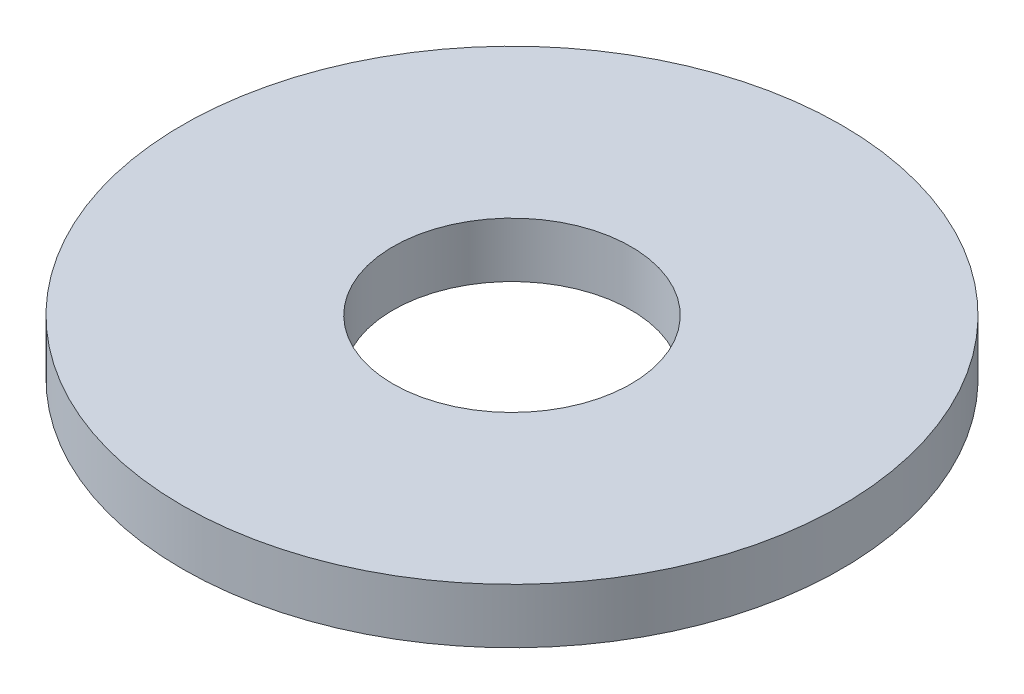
from build123d import *

# Parameters (mm, degrees)
SKETCH1_R           = 18
SKETCH1_R_2         = 6.5
BOSS_EXTRUDE1_DEPTH = 3


with BuildPart() as part:
    # Sketch1 → Boss-Extrude1 (new body)
    with BuildSketch(Plane(origin=(0, 0, 0), x_dir=(1, 0, 0), z_dir=(0, 1, 0))):
        with Locations(Location((0, 0, 0), (0, 0, 270))):
            Circle(SKETCH1_R)
        with Locations(Location((0, 0, 0), (0, 0, 270))):
            Circle(SKETCH1_R_2, mode=Mode.SUBTRACT)
    extrude(amount=BOSS_EXTRUDE1_DEPTH)


solid = part.part
